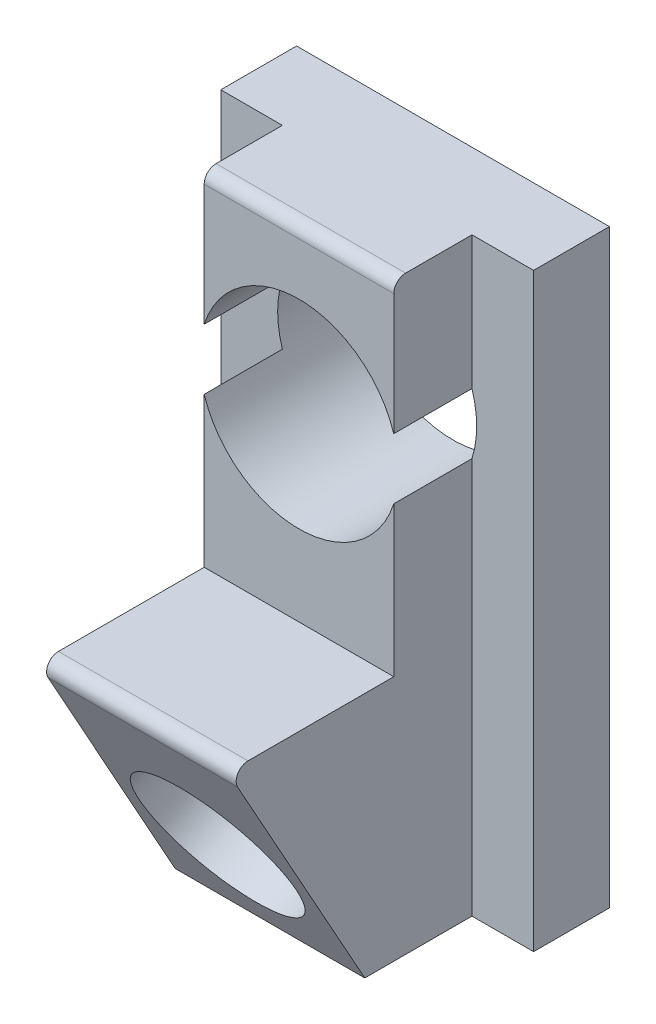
ISO-10303-21;
HEADER;
FILE_DESCRIPTION(('STEP AP214'),'2;1');
FILE_NAME('part.step','',(''),(''),'','','');
FILE_SCHEMA(('AUTOMOTIVE_DESIGN { 1 0 10303 214 1 1 1 1 }'));
ENDSEC;
DATA;
#1=APPLICATION_CONTEXT('core data for automotive mechanical design processes');
#2=APPLICATION_PROTOCOL_DEFINITION('international standard','automotive_design',2000,#1);
#3=PRODUCT_CONTEXT('',#1,'mechanical');
#4=PRODUCT('Part','Part','',(#3));
#5=PRODUCT_RELATED_PRODUCT_CATEGORY('part','',(#4));
#6=PRODUCT_DEFINITION_FORMATION('','',#4);
#7=PRODUCT_DEFINITION_CONTEXT('part definition',#1,'design');
#8=PRODUCT_DEFINITION('design','',#6,#7);
#9=PRODUCT_DEFINITION_SHAPE('','',#8);
#10=(LENGTH_UNIT() NAMED_UNIT(*) SI_UNIT(.MILLI.,.METRE.));
#11=(NAMED_UNIT(*) PLANE_ANGLE_UNIT() SI_UNIT($,.RADIAN.));
#12=(NAMED_UNIT(*) SI_UNIT($,.STERADIAN.) SOLID_ANGLE_UNIT());
#13=UNCERTAINTY_MEASURE_WITH_UNIT(LENGTH_MEASURE(1.E-05),#10,'distance_accuracy_value','');
#14=(GEOMETRIC_REPRESENTATION_CONTEXT(3) GLOBAL_UNCERTAINTY_ASSIGNED_CONTEXT((#13)) GLOBAL_UNIT_ASSIGNED_CONTEXT((#10,
#11,#12)) REPRESENTATION_CONTEXT('',''));
#15=CARTESIAN_POINT('',(0.,0.,0.));
#16=DIRECTION('',(0.,0.,1.));
#17=DIRECTION('',(1.,0.,0.));
#18=AXIS2_PLACEMENT_3D('',#15,#16,#17);
#19=CARTESIAN_POINT('',(-4.,6.39999999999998,7.));
#20=DIRECTION('',(1.,0.,0.));
#21=DIRECTION('',(0.,0.,-1.));
#22=AXIS2_PLACEMENT_3D('',#19,#20,#21);
#23=CYLINDRICAL_SURFACE('',#22,0.5);
#24=CARTESIAN_POINT('',(-4.,6.39999999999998,7.));
#25=DIRECTION('',(1.,0.,0.));
#26=DIRECTION('',(0.,0.,-1.));
#27=AXIS2_PLACEMENT_3D('',#24,#25,#26);
#28=CIRCLE('',#27,0.5);
#29=CARTESIAN_POINT('',(-4.,6.39999999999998,7.50000000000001));
#30=VERTEX_POINT('',#29);
#31=CARTESIAN_POINT('',(-4.,6.89999999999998,7.));
#32=VERTEX_POINT('',#31);
#33=EDGE_CURVE('E105',#30,#32,#28,.F.);
#34=ORIENTED_EDGE('',*,*,#33,.F.);
#35=DIRECTION('',(1.,0.,0.));
#36=VECTOR('',#35,1.);
#37=CARTESIAN_POINT('',(-4.,6.39999999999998,7.50000000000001));
#38=LINE('',#37,#36);
#39=CARTESIAN_POINT('',(4.,6.39999999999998,7.50000000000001));
#40=VERTEX_POINT('',#39);
#41=EDGE_CURVE('E108',#40,#30,#38,.F.);
#42=ORIENTED_EDGE('',*,*,#41,.F.);
#43=CARTESIAN_POINT('',(4.,6.39999999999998,7.));
#44=DIRECTION('',(1.,0.,0.));
#45=DIRECTION('',(0.,0.,-1.));
#46=AXIS2_PLACEMENT_3D('',#43,#44,#45);
#47=CIRCLE('',#46,0.5);
#48=CARTESIAN_POINT('',(4.,6.89999999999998,7.));
#49=VERTEX_POINT('',#48);
#50=EDGE_CURVE('E19',#40,#49,#47,.F.);
#51=ORIENTED_EDGE('',*,*,#50,.T.);
#52=DIRECTION('',(1.,0.,0.));
#53=VECTOR('',#52,1.);
#54=CARTESIAN_POINT('',(-4.,6.89999999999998,7.));
#55=LINE('',#54,#53);
#56=EDGE_CURVE('E160',#32,#49,#55,.T.);
#57=ORIENTED_EDGE('',*,*,#56,.F.);
#58=EDGE_LOOP('',(#34,#42,#51,#57));
#59=FACE_BOUND('',#58,.T.);
#60=ADVANCED_FACE('F15',(#59),#23,.T.);
#61=CARTESIAN_POINT('',(4.,6.89999999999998,0.999999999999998));
#62=DIRECTION('',(-1.,0.,0.));
#63=DIRECTION('',(0.,0.,1.));
#64=AXIS2_PLACEMENT_3D('',#61,#62,#63);
#65=PLANE('',#64);
#66=DIRECTION('',(0.,1.,0.));
#67=VECTOR('',#66,1.);
#68=CARTESIAN_POINT('',(4.,6.89999999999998,4.2));
#69=LINE('',#68,#67);
#70=CARTESIAN_POINT('',(4.,6.89999999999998,4.2));
#71=VERTEX_POINT('',#70);
#72=CARTESIAN_POINT('',(4.,1.28062484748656,4.2));
#73=VERTEX_POINT('',#72);
#74=EDGE_CURVE('E116',#71,#73,#69,.F.);
#75=ORIENTED_EDGE('',*,*,#74,.F.);
#76=DIRECTION('',(0.,0.,1.));
#77=VECTOR('',#76,1.);
#78=CARTESIAN_POINT('',(4.,6.89999999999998,7.));
#79=LINE('',#78,#77);
#80=EDGE_CURVE('E101',#49,#71,#79,.F.);
#81=ORIENTED_EDGE('',*,*,#80,.F.);
#82=ORIENTED_EDGE('',*,*,#50,.F.);
#83=DIRECTION('',(0.,1.,0.));
#84=VECTOR('',#83,1.);
#85=CARTESIAN_POINT('',(4.,-7.60000000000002,7.50000000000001));
#86=LINE('',#85,#84);
#87=CARTESIAN_POINT('',(4.,1.28062484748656,7.5));
#88=VERTEX_POINT('',#87);
#89=EDGE_CURVE('E98',#88,#40,#86,.T.);
#90=ORIENTED_EDGE('',*,*,#89,.F.);
#91=DIRECTION('',(0.,0.,1.));
#92=VECTOR('',#91,1.);
#93=CARTESIAN_POINT('',(4.,1.28062484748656,1.));
#94=LINE('',#93,#92);
#95=EDGE_CURVE('E148',#88,#73,#94,.F.);
#96=ORIENTED_EDGE('',*,*,#95,.T.);
#97=EDGE_LOOP('',(#75,#81,#82,#90,#96));
#98=FACE_BOUND('',#97,.T.);
#99=ADVANCED_FACE('F96',(#98),#65,.F.);
#100=CARTESIAN_POINT('',(-4.00000000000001,-7.37578842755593,7.83169443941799));
#101=DIRECTION('',(-1.,0.,0.));
#102=DIRECTION('',(0.,0.,1.));
#103=AXIS2_PLACEMENT_3D('',#100,#101,#102);
#104=PLANE('',#103);
#105=DIRECTION('',(0.,0.,1.));
#106=VECTOR('',#105,1.);
#107=CARTESIAN_POINT('',(-4.00000000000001,6.89999999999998,7.));
#108=LINE('',#107,#106);
#109=CARTESIAN_POINT('',(-4.00000000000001,6.89999999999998,4.2));
#110=VERTEX_POINT('',#109);
#111=EDGE_CURVE('E153',#110,#32,#108,.T.);
#112=ORIENTED_EDGE('',*,*,#111,.F.);
#113=DIRECTION('',(0.,1.,0.));
#114=VECTOR('',#113,1.);
#115=CARTESIAN_POINT('',(-4.00000000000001,6.89999999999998,4.2));
#116=LINE('',#115,#114);
#117=CARTESIAN_POINT('',(-4.00000000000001,1.28062484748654,4.2));
#118=VERTEX_POINT('',#117);
#119=EDGE_CURVE('E267',#118,#110,#116,.T.);
#120=ORIENTED_EDGE('',*,*,#119,.F.);
#121=DIRECTION('',(0.,0.,1.));
#122=VECTOR('',#121,1.);
#123=CARTESIAN_POINT('',(-4.00000000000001,1.28062484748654,1.));
#124=LINE('',#123,#122);
#125=CARTESIAN_POINT('',(-4.,1.28062484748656,7.5));
#126=VERTEX_POINT('',#125);
#127=EDGE_CURVE('E140',#118,#126,#124,.T.);
#128=ORIENTED_EDGE('',*,*,#127,.T.);
#129=DIRECTION('',(0.,1.,0.));
#130=VECTOR('',#129,1.);
#131=CARTESIAN_POINT('',(-4.,-7.60000000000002,7.50000000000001));
#132=LINE('',#131,#130);
#133=EDGE_CURVE('E114',#30,#126,#132,.F.);
#134=ORIENTED_EDGE('',*,*,#133,.F.);
#135=ORIENTED_EDGE('',*,*,#33,.T.);
#136=EDGE_LOOP('',(#112,#120,#128,#134,#135));
#137=FACE_BOUND('',#136,.T.);
#138=ADVANCED_FACE('F152',(#137),#104,.T.);
#139=CARTESIAN_POINT('',(-4.,-7.60000000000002,7.50000000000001));
#140=DIRECTION('',(0.,0.,1.));
#141=DIRECTION('',(1.,0.,0.));
#142=AXIS2_PLACEMENT_3D('',#139,#140,#141);
#143=PLANE('',#142);
#144=ORIENTED_EDGE('',*,*,#41,.T.);
#145=ORIENTED_EDGE('',*,*,#133,.T.);
#146=CARTESIAN_POINT('',(0.,0.,7.5));
#147=DIRECTION('',(0.,0.,1.));
#148=DIRECTION('',(1.,0.,0.));
#149=AXIS2_PLACEMENT_3D('',#146,#147,#148);
#150=CIRCLE('',#149,4.2);
#151=EDGE_CURVE('E111',#126,#88,#150,.F.);
#152=ORIENTED_EDGE('',*,*,#151,.T.);
#153=ORIENTED_EDGE('',*,*,#89,.T.);
#154=EDGE_LOOP('',(#144,#145,#152,#153));
#155=FACE_BOUND('',#154,.T.);
#156=ADVANCED_FACE('F107',(#155),#143,.T.);
#157=CARTESIAN_POINT('',(6.6,6.89999999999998,4.2));
#158=DIRECTION('',(0.,0.,1.));
#159=DIRECTION('',(1.,0.,0.));
#160=AXIS2_PLACEMENT_3D('',#157,#158,#159);
#161=PLANE('',#160);
#162=CARTESIAN_POINT('',(0.,0.,4.2));
#163=DIRECTION('',(0.,0.,1.));
#164=DIRECTION('',(1.,0.,0.));
#165=AXIS2_PLACEMENT_3D('',#162,#163,#164);
#166=CIRCLE('',#165,4.2);
#167=CARTESIAN_POINT('',(4.,-1.28062484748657,4.2));
#168=VERTEX_POINT('',#167);
#169=EDGE_CURVE('E147',#73,#168,#166,.F.);
#170=ORIENTED_EDGE('',*,*,#169,.T.);
#171=DIRECTION('',(0.,1.,0.));
#172=VECTOR('',#171,1.);
#173=CARTESIAN_POINT('',(4.,6.89999999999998,4.2));
#174=LINE('',#173,#172);
#175=CARTESIAN_POINT('',(4.,-18.,4.2));
#176=VERTEX_POINT('',#175);
#177=EDGE_CURVE('E235',#168,#176,#174,.F.);
#178=ORIENTED_EDGE('',*,*,#177,.T.);
#179=DIRECTION('',(1.,0.,0.));
#180=VECTOR('',#179,1.);
#181=CARTESIAN_POINT('',(0.,-18.,4.20000000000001));
#182=LINE('',#181,#180);
#183=CARTESIAN_POINT('',(6.59999999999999,-18.,4.2));
#184=VERTEX_POINT('',#183);
#185=EDGE_CURVE('E139',#176,#184,#182,.T.);
#186=ORIENTED_EDGE('',*,*,#185,.T.);
#187=DIRECTION('',(0.,1.,0.));
#188=VECTOR('',#187,1.);
#189=CARTESIAN_POINT('',(6.6,6.89999999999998,4.2));
#190=LINE('',#189,#188);
#191=CARTESIAN_POINT('',(6.6,6.89999999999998,4.2));
#192=VERTEX_POINT('',#191);
#193=EDGE_CURVE('E171',#192,#184,#190,.F.);
#194=ORIENTED_EDGE('',*,*,#193,.F.);
#195=DIRECTION('',(1.,0.,0.));
#196=VECTOR('',#195,1.);
#197=CARTESIAN_POINT('',(-4.,6.89999999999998,4.2));
#198=LINE('',#197,#196);
#199=EDGE_CURVE('E166',#71,#192,#198,.T.);
#200=ORIENTED_EDGE('',*,*,#199,.F.);
#201=ORIENTED_EDGE('',*,*,#74,.T.);
#202=EDGE_LOOP('',(#170,#178,#186,#194,#200,#201));
#203=FACE_BOUND('',#202,.T.);
#204=ADVANCED_FACE('F234',(#203),#161,.T.);
#205=CARTESIAN_POINT('',(-4.00000000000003,-7.60000000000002,13.6502427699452));
#206=DIRECTION('',(0.,1.,0.));
#207=DIRECTION('',(0.,0.,1.));
#208=AXIS2_PLACEMENT_3D('',#205,#206,#207);
#209=PLANE('',#208);
#210=DIRECTION('',(0.,0.,1.));
#211=VECTOR('',#210,1.);
#212=CARTESIAN_POINT('',(-4.00000000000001,-7.60000000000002,7.83169443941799));
#213=LINE('',#212,#211);
#214=CARTESIAN_POINT('',(-4.00000000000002,-7.60000000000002,13.6502427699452));
#215=VERTEX_POINT('',#214);
#216=CARTESIAN_POINT('',(-4.00000000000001,-7.60000000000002,7.5));
#217=VERTEX_POINT('',#216);
#218=EDGE_CURVE('E131',#215,#217,#213,.F.);
#219=ORIENTED_EDGE('',*,*,#218,.F.);
#220=DIRECTION('',(1.,0.,0.));
#221=VECTOR('',#220,1.);
#222=CARTESIAN_POINT('',(-4.00000000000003,-7.60000000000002,13.6502427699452));
#223=LINE('',#222,#221);
#224=CARTESIAN_POINT('',(4.,-7.60000000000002,13.6502427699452));
#225=VERTEX_POINT('',#224);
#226=EDGE_CURVE('E136',#225,#215,#223,.F.);
#227=ORIENTED_EDGE('',*,*,#226,.F.);
#228=DIRECTION('',(0.,0.,1.));
#229=VECTOR('',#228,1.);
#230=CARTESIAN_POINT('',(4.,-7.60000000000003,0.999999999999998));
#231=LINE('',#230,#229);
#232=CARTESIAN_POINT('',(4.,-7.60000000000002,7.5));
#233=VERTEX_POINT('',#232);
#234=EDGE_CURVE('E252',#225,#233,#231,.F.);
#235=ORIENTED_EDGE('',*,*,#234,.T.);
#236=DIRECTION('',(1.,0.,0.));
#237=VECTOR('',#236,1.);
#238=CARTESIAN_POINT('',(-4.,-7.60000000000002,7.50000000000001));
#239=LINE('',#238,#237);
#240=EDGE_CURVE('E250',#217,#233,#239,.T.);
#241=ORIENTED_EDGE('',*,*,#240,.F.);
#242=EDGE_LOOP('',(#219,#227,#235,#241));
#243=FACE_BOUND('',#242,.T.);
#244=ADVANCED_FACE('F295',(#243),#209,.T.);
#245=CARTESIAN_POINT('',(-4.,-7.60000000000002,7.50000000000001));
#246=DIRECTION('',(0.,0.,1.));
#247=DIRECTION('',(1.,0.,0.));
#248=AXIS2_PLACEMENT_3D('',#245,#246,#247);
#249=PLANE('',#248);
#250=ORIENTED_EDGE('',*,*,#240,.T.);
#251=DIRECTION('',(0.,1.,0.));
#252=VECTOR('',#251,1.);
#253=CARTESIAN_POINT('',(4.,6.89999999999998,7.50000000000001));
#254=LINE('',#253,#252);
#255=CARTESIAN_POINT('',(4.,-1.28062484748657,7.5));
#256=VERTEX_POINT('',#255);
#257=EDGE_CURVE('E245',#233,#256,#254,.T.);
#258=ORIENTED_EDGE('',*,*,#257,.T.);
#259=CARTESIAN_POINT('',(0.,0.,7.5));
#260=DIRECTION('',(0.,0.,1.));
#261=DIRECTION('',(1.,0.,0.));
#262=AXIS2_PLACEMENT_3D('',#259,#260,#261);
#263=CIRCLE('',#262,4.2);
#264=CARTESIAN_POINT('',(-4.00000000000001,-1.28062484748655,7.5));
#265=VERTEX_POINT('',#264);
#266=EDGE_CURVE('E144',#256,#265,#263,.F.);
#267=ORIENTED_EDGE('',*,*,#266,.T.);
#268=DIRECTION('',(0.,1.,0.));
#269=VECTOR('',#268,1.);
#270=CARTESIAN_POINT('',(-4.00000000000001,-7.37578842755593,7.50000000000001));
#271=LINE('',#270,#269);
#272=EDGE_CURVE('E268',#217,#265,#271,.T.);
#273=ORIENTED_EDGE('',*,*,#272,.F.);
#274=EDGE_LOOP('',(#250,#258,#267,#273));
#275=FACE_BOUND('',#274,.T.);
#276=ADVANCED_FACE('F297',(#275),#249,.T.);
#277=CARTESIAN_POINT('',(6.6,6.89999999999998,4.2));
#278=DIRECTION('',(0.,0.,1.));
#279=DIRECTION('',(1.,0.,0.));
#280=AXIS2_PLACEMENT_3D('',#277,#278,#279);
#281=PLANE('',#280);
#282=DIRECTION('',(1.,0.,0.));
#283=VECTOR('',#282,1.);
#284=CARTESIAN_POINT('',(-4.,6.89999999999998,4.2));
#285=LINE('',#284,#283);
#286=CARTESIAN_POINT('',(-6.60000000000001,6.89999999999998,4.2));
#287=VERTEX_POINT('',#286);
#288=EDGE_CURVE('E162',#287,#110,#285,.T.);
#289=ORIENTED_EDGE('',*,*,#288,.F.);
#290=DIRECTION('',(0.,1.,0.));
#291=VECTOR('',#290,1.);
#292=CARTESIAN_POINT('',(-6.60000000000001,-21.1,4.20000000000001));
#293=LINE('',#292,#291);
#294=CARTESIAN_POINT('',(-6.60000000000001,-18.,4.20000000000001));
#295=VERTEX_POINT('',#294);
#296=EDGE_CURVE('E163',#295,#287,#293,.T.);
#297=ORIENTED_EDGE('',*,*,#296,.F.);
#298=DIRECTION('',(1.,0.,0.));
#299=VECTOR('',#298,1.);
#300=CARTESIAN_POINT('',(0.,-18.,4.20000000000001));
#301=LINE('',#300,#299);
#302=CARTESIAN_POINT('',(-4.00000000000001,-18.,4.20000000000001));
#303=VERTEX_POINT('',#302);
#304=EDGE_CURVE('E253',#295,#303,#301,.T.);
#305=ORIENTED_EDGE('',*,*,#304,.T.);
#306=DIRECTION('',(0.,1.,0.));
#307=VECTOR('',#306,1.);
#308=CARTESIAN_POINT('',(-4.00000000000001,-7.37578842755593,4.2));
#309=LINE('',#308,#307);
#310=CARTESIAN_POINT('',(-4.00000000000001,-1.28062484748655,4.2));
#311=VERTEX_POINT('',#310);
#312=EDGE_CURVE('E211',#311,#303,#309,.F.);
#313=ORIENTED_EDGE('',*,*,#312,.F.);
#314=CARTESIAN_POINT('',(0.,0.,4.2));
#315=DIRECTION('',(0.,0.,1.));
#316=DIRECTION('',(1.,0.,0.));
#317=AXIS2_PLACEMENT_3D('',#314,#315,#316);
#318=CIRCLE('',#317,4.2);
#319=EDGE_CURVE('E141',#311,#118,#318,.F.);
#320=ORIENTED_EDGE('',*,*,#319,.T.);
#321=ORIENTED_EDGE('',*,*,#119,.T.);
#322=EDGE_LOOP('',(#289,#297,#305,#313,#320,#321));
#323=FACE_BOUND('',#322,.T.);
#324=ADVANCED_FACE('F300',(#323),#281,.T.);
#325=CARTESIAN_POINT('',(-6.60000000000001,-21.1,1.));
#326=DIRECTION('',(-1.,0.,0.));
#327=DIRECTION('',(0.,0.,1.));
#328=AXIS2_PLACEMENT_3D('',#325,#326,#327);
#329=PLANE('',#328);
#330=DIRECTION('',(0.,0.,1.));
#331=VECTOR('',#330,1.);
#332=CARTESIAN_POINT('',(-6.6,6.89999999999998,7.));
#333=LINE('',#332,#331);
#334=CARTESIAN_POINT('',(-6.60000000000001,6.89999999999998,1.));
#335=VERTEX_POINT('',#334);
#336=EDGE_CURVE('E119',#335,#287,#333,.T.);
#337=ORIENTED_EDGE('',*,*,#336,.F.);
#338=DIRECTION('',(0.,1.,0.));
#339=VECTOR('',#338,1.);
#340=CARTESIAN_POINT('',(-6.60000000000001,6.89999999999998,1.));
#341=LINE('',#340,#339);
#342=CARTESIAN_POINT('',(-6.60000000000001,-18.,1.));
#343=VERTEX_POINT('',#342);
#344=EDGE_CURVE('E184',#343,#335,#341,.T.);
#345=ORIENTED_EDGE('',*,*,#344,.F.);
#346=DIRECTION('',(0.,0.,1.));
#347=VECTOR('',#346,1.);
#348=CARTESIAN_POINT('',(-6.60000000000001,-18.,9.58946273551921));
#349=LINE('',#348,#347);
#350=EDGE_CURVE('E210',#343,#295,#349,.T.);
#351=ORIENTED_EDGE('',*,*,#350,.T.);
#352=ORIENTED_EDGE('',*,*,#296,.T.);
#353=EDGE_LOOP('',(#337,#345,#351,#352));
#354=FACE_BOUND('',#353,.T.);
#355=ADVANCED_FACE('F329',(#354),#329,.T.);
#356=CARTESIAN_POINT('',(-4.,6.89999999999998,7.));
#357=DIRECTION('',(0.,1.,0.));
#358=DIRECTION('',(0.,0.,1.));
#359=AXIS2_PLACEMENT_3D('',#356,#357,#358);
#360=PLANE('',#359);
#361=ORIENTED_EDGE('',*,*,#336,.T.);
#362=ORIENTED_EDGE('',*,*,#288,.T.);
#363=ORIENTED_EDGE('',*,*,#111,.T.);
#364=ORIENTED_EDGE('',*,*,#56,.T.);
#365=ORIENTED_EDGE('',*,*,#80,.T.);
#366=ORIENTED_EDGE('',*,*,#199,.T.);
#367=DIRECTION('',(0.,0.,-1.));
#368=VECTOR('',#367,1.);
#369=CARTESIAN_POINT('',(6.6,6.89999999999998,0.999999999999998));
#370=LINE('',#369,#368);
#371=CARTESIAN_POINT('',(6.6,6.89999999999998,1.));
#372=VERTEX_POINT('',#371);
#373=EDGE_CURVE('E169',#372,#192,#370,.F.);
#374=ORIENTED_EDGE('',*,*,#373,.F.);
#375=DIRECTION('',(-1.,0.,0.));
#376=VECTOR('',#375,1.);
#377=CARTESIAN_POINT('',(-4.,6.89999999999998,1.));
#378=LINE('',#377,#376);
#379=EDGE_CURVE('E182',#335,#372,#378,.F.);
#380=ORIENTED_EDGE('',*,*,#379,.F.);
#381=EDGE_LOOP('',(#361,#362,#363,#364,#365,#366,#374,#380));
#382=FACE_BOUND('',#381,.T.);
#383=ADVANCED_FACE('F159',(#382),#360,.T.);
#384=CARTESIAN_POINT('',(6.6,6.89999999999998,0.999999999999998));
#385=DIRECTION('',(1.,0.,0.));
#386=DIRECTION('',(0.,0.,-1.));
#387=AXIS2_PLACEMENT_3D('',#384,#385,#386);
#388=PLANE('',#387);
#389=ORIENTED_EDGE('',*,*,#373,.T.);
#390=ORIENTED_EDGE('',*,*,#193,.T.);
#391=DIRECTION('',(0.,0.,1.));
#392=VECTOR('',#391,1.);
#393=CARTESIAN_POINT('',(6.59999999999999,-18.,9.58946273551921));
#394=LINE('',#393,#392);
#395=CARTESIAN_POINT('',(6.6,-18.,1.));
#396=VERTEX_POINT('',#395);
#397=EDGE_CURVE('E206',#184,#396,#394,.F.);
#398=ORIENTED_EDGE('',*,*,#397,.T.);
#399=DIRECTION('',(0.,1.,0.));
#400=VECTOR('',#399,1.);
#401=CARTESIAN_POINT('',(6.6,6.89999999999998,1.));
#402=LINE('',#401,#400);
#403=EDGE_CURVE('E127',#372,#396,#402,.F.);
#404=ORIENTED_EDGE('',*,*,#403,.F.);
#405=EDGE_LOOP('',(#389,#390,#398,#404));
#406=FACE_BOUND('',#405,.T.);
#407=ADVANCED_FACE('F332',(#406),#388,.T.);
#408=CARTESIAN_POINT('',(0.,0.,1.));
#409=DIRECTION('',(0.,0.,1.));
#410=DIRECTION('',(1.,0.,0.));
#411=AXIS2_PLACEMENT_3D('',#408,#409,#410);
#412=CYLINDRICAL_SURFACE('',#411,4.2);
#413=CARTESIAN_POINT('',(0.,0.,0.999999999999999));
#414=DIRECTION('',(0.,0.,1.));
#415=DIRECTION('',(1.,0.,0.));
#416=AXIS2_PLACEMENT_3D('',#413,#414,#415);
#417=CIRCLE('',#416,4.2);
#418=CARTESIAN_POINT('',(0.,4.2,0.999999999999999));
#419=VERTEX_POINT('',#418);
#420=EDGE_CURVE('E32',#419,#419,#417,.T.);
#421=ORIENTED_EDGE('',*,*,#420,.F.);
#422=EDGE_LOOP('',(#421));
#423=FACE_BOUND('',#422,.T.);
#424=ORIENTED_EDGE('',*,*,#127,.F.);
#425=ORIENTED_EDGE('',*,*,#319,.F.);
#426=DIRECTION('',(0.,0.,1.));
#427=VECTOR('',#426,1.);
#428=CARTESIAN_POINT('',(-4.00000000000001,-1.28062484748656,7.83169443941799));
#429=LINE('',#428,#427);
#430=EDGE_CURVE('E215',#265,#311,#429,.F.);
#431=ORIENTED_EDGE('',*,*,#430,.F.);
#432=ORIENTED_EDGE('',*,*,#266,.F.);
#433=DIRECTION('',(0.,0.,1.));
#434=VECTOR('',#433,1.);
#435=CARTESIAN_POINT('',(4.,-1.28062484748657,0.999999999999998));
#436=LINE('',#435,#434);
#437=EDGE_CURVE('E230',#256,#168,#436,.F.);
#438=ORIENTED_EDGE('',*,*,#437,.T.);
#439=ORIENTED_EDGE('',*,*,#169,.F.);
#440=ORIENTED_EDGE('',*,*,#95,.F.);
#441=ORIENTED_EDGE('',*,*,#151,.F.);
#442=EDGE_LOOP('',(#424,#425,#431,#432,#438,#439,#440,#441));
#443=FACE_BOUND('',#442,.T.);
#444=ADVANCED_FACE('F227',(#423,#443),#412,.F.);
#445=CARTESIAN_POINT('',(0.,-18.,9.58946273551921));
#446=DIRECTION('',(0.,1.,0.));
#447=DIRECTION('',(0.,0.,1.));
#448=AXIS2_PLACEMENT_3D('',#445,#446,#447);
#449=PLANE('',#448);
#450=ORIENTED_EDGE('',*,*,#350,.F.);
#451=DIRECTION('',(-1.,0.,0.));
#452=VECTOR('',#451,1.);
#453=CARTESIAN_POINT('',(-4.,-18.,1.));
#454=LINE('',#453,#452);
#455=EDGE_CURVE('E195',#396,#343,#454,.T.);
#456=ORIENTED_EDGE('',*,*,#455,.F.);
#457=ORIENTED_EDGE('',*,*,#397,.F.);
#458=ORIENTED_EDGE('',*,*,#185,.F.);
#459=DIRECTION('',(0.,0.,1.));
#460=VECTOR('',#459,1.);
#461=CARTESIAN_POINT('',(4.,-18.,0.999999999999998));
#462=LINE('',#461,#460);
#463=CARTESIAN_POINT('',(3.99999999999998,-18.,8.72222222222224));
#464=VERTEX_POINT('',#463);
#465=EDGE_CURVE('E137',#176,#464,#462,.T.);
#466=ORIENTED_EDGE('',*,*,#465,.T.);
#467=DIRECTION('',(1.,0.,0.));
#468=VECTOR('',#467,1.);
#469=CARTESIAN_POINT('',(-4.00000000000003,-18.,8.72222222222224));
#470=LINE('',#469,#468);
#471=CARTESIAN_POINT('',(-4.00000000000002,-18.,8.72222222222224));
#472=VERTEX_POINT('',#471);
#473=EDGE_CURVE('E126',#472,#464,#470,.T.);
#474=ORIENTED_EDGE('',*,*,#473,.F.);
#475=DIRECTION('',(0.,0.,1.));
#476=VECTOR('',#475,1.);
#477=CARTESIAN_POINT('',(-4.00000000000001,-18.,7.83169443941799));
#478=LINE('',#477,#476);
#479=EDGE_CURVE('E132',#303,#472,#478,.T.);
#480=ORIENTED_EDGE('',*,*,#479,.F.);
#481=ORIENTED_EDGE('',*,*,#304,.F.);
#482=EDGE_LOOP('',(#450,#456,#457,#458,#466,#474,#480,#481));
#483=FACE_BOUND('',#482,.T.);
#484=ADVANCED_FACE('F204',(#483),#449,.F.);
#485=CARTESIAN_POINT('',(4.,6.89999999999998,0.999999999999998));
#486=DIRECTION('',(-1.,0.,0.));
#487=DIRECTION('',(0.,0.,1.));
#488=AXIS2_PLACEMENT_3D('',#485,#486,#487);
#489=PLANE('',#488);
#490=ORIENTED_EDGE('',*,*,#177,.F.);
#491=ORIENTED_EDGE('',*,*,#437,.F.);
#492=ORIENTED_EDGE('',*,*,#257,.F.);
#493=ORIENTED_EDGE('',*,*,#234,.F.);
#494=CARTESIAN_POINT('',(4.,-8.10000000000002,13.6502427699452));
#495=DIRECTION('',(1.,0.,0.));
#496=DIRECTION('',(0.,0.,-1.));
#497=AXIS2_PLACEMENT_3D('',#494,#495,#496);
#498=CIRCLE('',#497,0.5);
#499=CARTESIAN_POINT('',(3.99999999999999,-8.34282146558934,14.0873214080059));
#500=VERTEX_POINT('',#499);
#501=EDGE_CURVE('E133',#500,#225,#498,.F.);
#502=ORIENTED_EDGE('',*,*,#501,.F.);
#503=DIRECTION('',(0.,-0.874157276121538,-0.485642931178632));
#504=VECTOR('',#503,1.);
#505=CARTESIAN_POINT('',(3.99999999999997,-20.8428214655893,7.1428769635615));
#506=LINE('',#505,#504);
#507=EDGE_CURVE('E274',#464,#500,#506,.F.);
#508=ORIENTED_EDGE('',*,*,#507,.F.);
#509=ORIENTED_EDGE('',*,*,#465,.F.);
#510=EDGE_LOOP('',(#490,#491,#492,#493,#502,#508,#509));
#511=FACE_BOUND('',#510,.T.);
#512=ADVANCED_FACE('F238',(#511),#489,.F.);
#513=CARTESIAN_POINT('',(-4.00000000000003,-8.10000000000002,13.6502427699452));
#514=DIRECTION('',(1.,0.,0.));
#515=DIRECTION('',(0.,0.,-1.));
#516=AXIS2_PLACEMENT_3D('',#513,#514,#515);
#517=CYLINDRICAL_SURFACE('',#516,0.5);
#518=CARTESIAN_POINT('',(-4.00000000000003,-8.10000000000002,13.6502427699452));
#519=DIRECTION('',(1.,0.,0.));
#520=DIRECTION('',(0.,0.,-1.));
#521=AXIS2_PLACEMENT_3D('',#518,#519,#520);
#522=CIRCLE('',#521,0.5);
#523=CARTESIAN_POINT('',(-4.00000000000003,-8.34282146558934,14.0873214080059));
#524=VERTEX_POINT('',#523);
#525=EDGE_CURVE('E128',#524,#215,#522,.F.);
#526=ORIENTED_EDGE('',*,*,#525,.F.);
#527=DIRECTION('',(1.,0.,0.));
#528=VECTOR('',#527,1.);
#529=CARTESIAN_POINT('',(-4.00000000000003,-8.34282146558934,14.0873214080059));
#530=LINE('',#529,#528);
#531=EDGE_CURVE('E276',#500,#524,#530,.F.);
#532=ORIENTED_EDGE('',*,*,#531,.F.);
#533=ORIENTED_EDGE('',*,*,#501,.T.);
#534=ORIENTED_EDGE('',*,*,#226,.T.);
#535=EDGE_LOOP('',(#526,#532,#533,#534));
#536=FACE_BOUND('',#535,.T.);
#537=ADVANCED_FACE('F319',(#536),#517,.T.);
#538=CARTESIAN_POINT('',(-4.00000000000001,-7.37578842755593,7.83169443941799));
#539=DIRECTION('',(-1.,0.,0.));
#540=DIRECTION('',(0.,0.,1.));
#541=AXIS2_PLACEMENT_3D('',#538,#539,#540);
#542=PLANE('',#541);
#543=ORIENTED_EDGE('',*,*,#430,.T.);
#544=ORIENTED_EDGE('',*,*,#312,.T.);
#545=ORIENTED_EDGE('',*,*,#479,.T.);
#546=DIRECTION('',(0.,-0.874157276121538,-0.485642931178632));
#547=VECTOR('',#546,1.);
#548=CARTESIAN_POINT('',(-4.00000000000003,-20.8428214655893,7.1428769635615));
#549=LINE('',#548,#547);
#550=EDGE_CURVE('E124',#524,#472,#549,.T.);
#551=ORIENTED_EDGE('',*,*,#550,.F.);
#552=ORIENTED_EDGE('',*,*,#525,.T.);
#553=ORIENTED_EDGE('',*,*,#218,.T.);
#554=ORIENTED_EDGE('',*,*,#272,.T.);
#555=EDGE_LOOP('',(#543,#544,#545,#551,#552,#553,#554));
#556=FACE_BOUND('',#555,.T.);
#557=ADVANCED_FACE('F288',(#556),#542,.T.);
#558=CARTESIAN_POINT('',(-4.,6.89999999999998,1.));
#559=DIRECTION('',(0.,0.,-1.));
#560=DIRECTION('',(-1.,0.,0.));
#561=AXIS2_PLACEMENT_3D('',#558,#559,#560);
#562=PLANE('',#561);
#563=ORIENTED_EDGE('',*,*,#420,.T.);
#564=EDGE_LOOP('',(#563));
#565=FACE_BOUND('',#564,.T.);
#566=CARTESIAN_POINT('',(0.,-8.5078202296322,0.999999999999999));
#567=DIRECTION('',(0.,0.,-1.));
#568=DIRECTION('',(0.,1.,0.));
#569=AXIS2_PLACEMENT_3D('',#566,#567,#568);
#570=ELLIPSE('',#569,3.80194741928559,3.3235);
#571=CARTESIAN_POINT('',(0.,-12.3097676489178,1.));
#572=VERTEX_POINT('',#571);
#573=EDGE_CURVE('E25',#572,#572,#570,.F.);
#574=ORIENTED_EDGE('',*,*,#573,.T.);
#575=EDGE_LOOP('',(#574));
#576=FACE_BOUND('',#575,.T.);
#577=ORIENTED_EDGE('',*,*,#379,.T.);
#578=ORIENTED_EDGE('',*,*,#403,.T.);
#579=ORIENTED_EDGE('',*,*,#455,.T.);
#580=ORIENTED_EDGE('',*,*,#344,.T.);
#581=EDGE_LOOP('',(#577,#578,#579,#580));
#582=FACE_BOUND('',#581,.T.);
#583=ADVANCED_FACE('F192',(#565,#576,#582),#562,.T.);
#584=CARTESIAN_POINT('',(-4.00000000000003,-20.8428214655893,7.1428769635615));
#585=DIRECTION('',(0.,-0.485642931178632,0.874157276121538));
#586=DIRECTION('',(0.,-0.874157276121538,-0.485642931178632));
#587=AXIS2_PLACEMENT_3D('',#584,#585,#586);
#588=PLANE('',#587);
#589=CARTESIAN_POINT('',(0.,-14.0248437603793,10.9306423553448));
#590=DIRECTION('',(0.,0.485642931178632,-0.874157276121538));
#591=DIRECTION('',(0.,0.874157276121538,0.485642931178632));
#592=AXIS2_PLACEMENT_3D('',#589,#590,#591);
#593=CIRCLE('',#592,3.3235);
#594=CARTESIAN_POINT('',(3.32350000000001,-14.0248437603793,10.9306423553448));
#595=VERTEX_POINT('',#594);
#596=EDGE_CURVE('E10',#595,#595,#593,.T.);
#597=ORIENTED_EDGE('',*,*,#596,.T.);
#598=EDGE_LOOP('',(#597));
#599=FACE_BOUND('',#598,.T.);
#600=ORIENTED_EDGE('',*,*,#531,.T.);
#601=ORIENTED_EDGE('',*,*,#550,.T.);
#602=ORIENTED_EDGE('',*,*,#473,.T.);
#603=ORIENTED_EDGE('',*,*,#507,.T.);
#604=EDGE_LOOP('',(#600,#601,#602,#603));
#605=FACE_BOUND('',#604,.T.);
#606=ADVANCED_FACE('F310',(#599,#605),#588,.T.);
#607=CARTESIAN_POINT('',(0.,-15.395250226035,13.397373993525));
#608=DIRECTION('',(0.,0.485642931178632,-0.874157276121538));
#609=DIRECTION('',(0.,0.874157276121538,0.485642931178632));
#610=AXIS2_PLACEMENT_3D('',#607,#608,#609);
#611=CYLINDRICAL_SURFACE('',#610,3.3235);
#612=ORIENTED_EDGE('',*,*,#596,.F.);
#613=EDGE_LOOP('',(#612));
#614=FACE_BOUND('',#613,.T.);
#615=ORIENTED_EDGE('',*,*,#573,.F.);
#616=EDGE_LOOP('',(#615));
#617=FACE_BOUND('',#616,.T.);
#618=ADVANCED_FACE('F17',(#614,#617),#611,.F.);
#619=CLOSED_SHELL('',(#60,#99,#138,#156,#204,#244,#276,#324,#355,#383,#407,#444,#484,#512,#537,
#557,#583,#606,#618));
#620=MANIFOLD_SOLID_BREP('B1',#619);
#621=ADVANCED_BREP_SHAPE_REPRESENTATION('',(#18,#620),#14);
#622=SHAPE_DEFINITION_REPRESENTATION(#9,#621);
ENDSEC;
END-ISO-10303-21;
